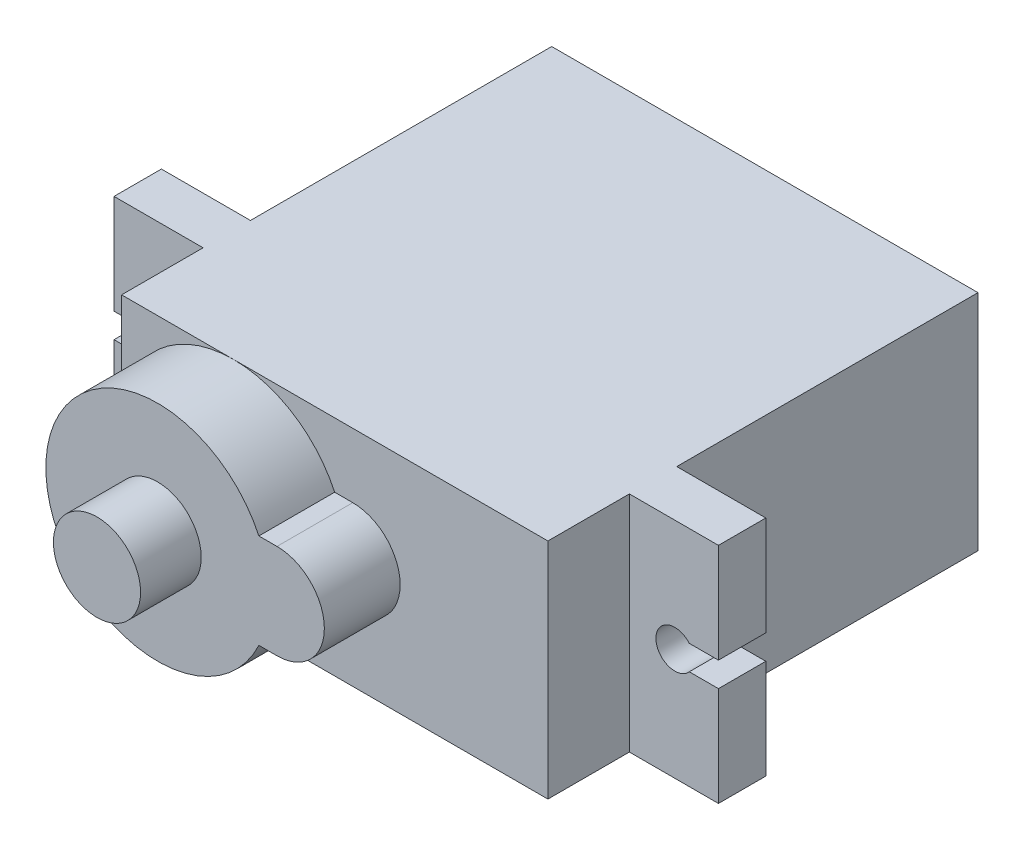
ISO-10303-21;
HEADER;
FILE_DESCRIPTION(('STEP AP214'),'2;1');
FILE_NAME('part.step','',(''),(''),'','','');
FILE_SCHEMA(('AUTOMOTIVE_DESIGN { 1 0 10303 214 1 1 1 1 }'));
ENDSEC;
DATA;
#1=APPLICATION_CONTEXT('core data for automotive mechanical design processes');
#2=APPLICATION_PROTOCOL_DEFINITION('international standard','automotive_design',2000,#1);
#3=PRODUCT_CONTEXT('',#1,'mechanical');
#4=PRODUCT('Part','Part','',(#3));
#5=PRODUCT_RELATED_PRODUCT_CATEGORY('part','',(#4));
#6=PRODUCT_DEFINITION_FORMATION('','',#4);
#7=PRODUCT_DEFINITION_CONTEXT('part definition',#1,'design');
#8=PRODUCT_DEFINITION('design','',#6,#7);
#9=PRODUCT_DEFINITION_SHAPE('','',#8);
#10=(LENGTH_UNIT() NAMED_UNIT(*) SI_UNIT(.MILLI.,.METRE.));
#11=(NAMED_UNIT(*) PLANE_ANGLE_UNIT() SI_UNIT($,.RADIAN.));
#12=(NAMED_UNIT(*) SI_UNIT($,.STERADIAN.) SOLID_ANGLE_UNIT());
#13=UNCERTAINTY_MEASURE_WITH_UNIT(LENGTH_MEASURE(1.E-05),#10,'distance_accuracy_value','');
#14=(GEOMETRIC_REPRESENTATION_CONTEXT(3) GLOBAL_UNCERTAINTY_ASSIGNED_CONTEXT((#13)) GLOBAL_UNIT_ASSIGNED_CONTEXT((#10,
#11,#12)) REPRESENTATION_CONTEXT('',''));
#15=CARTESIAN_POINT('',(0.,0.,0.));
#16=DIRECTION('',(0.,0.,1.));
#17=DIRECTION('',(1.,0.,0.));
#18=AXIS2_PLACEMENT_3D('',#15,#16,#17);
#19=CARTESIAN_POINT('',(-5.35,0.,21.95));
#20=DIRECTION('',(0.,0.,-1.));
#21=DIRECTION('',(0.,-1.,0.));
#22=AXIS2_PLACEMENT_3D('',#19,#20,#21);
#23=PLANE('',#22);
#24=CARTESIAN_POINT('',(-5.35,0.,21.95));
#25=DIRECTION('',(0.,0.,-1.));
#26=DIRECTION('',(1.,0.,0.));
#27=AXIS2_PLACEMENT_3D('',#24,#25,#26);
#28=CIRCLE('',#27,2.3);
#29=CARTESIAN_POINT('',(-3.05,0.,21.95));
#30=VERTEX_POINT('',#29);
#31=EDGE_CURVE('E10',#30,#30,#28,.T.);
#32=ORIENTED_EDGE('',*,*,#31,.F.);
#33=EDGE_LOOP('',(#32));
#34=FACE_BOUND('',#33,.T.);
#35=ADVANCED_FACE('F16',(#34),#23,.F.);
#36=CARTESIAN_POINT('',(-5.35,0.,21.95));
#37=DIRECTION('',(0.,0.,-1.));
#38=DIRECTION('',(-1.,0.,0.));
#39=AXIS2_PLACEMENT_3D('',#36,#37,#38);
#40=CYLINDRICAL_SURFACE('',#39,2.3);
#41=CARTESIAN_POINT('',(-5.35,0.,18.75));
#42=DIRECTION('',(0.,0.,-1.));
#43=DIRECTION('',(1.,0.,0.));
#44=AXIS2_PLACEMENT_3D('',#41,#42,#43);
#45=CIRCLE('',#44,2.3);
#46=CARTESIAN_POINT('',(-3.05,0.,18.75));
#47=VERTEX_POINT('',#46);
#48=EDGE_CURVE('E27',#47,#47,#45,.T.);
#49=ORIENTED_EDGE('',*,*,#48,.F.);
#50=EDGE_LOOP('',(#49));
#51=FACE_BOUND('',#50,.T.);
#52=ORIENTED_EDGE('',*,*,#31,.T.);
#53=EDGE_LOOP('',(#52));
#54=FACE_BOUND('',#53,.T.);
#55=ADVANCED_FACE('F627',(#51,#54),#40,.T.);
#56=CARTESIAN_POINT('',(-5.35,0.,18.75));
#57=DIRECTION('',(0.,0.,-1.));
#58=DIRECTION('',(0.,-1.,0.));
#59=AXIS2_PLACEMENT_3D('',#56,#57,#58);
#60=PLANE('',#59);
#61=DIRECTION('',(-1.,0.,0.));
#62=VECTOR('',#61,1.);
#63=CARTESIAN_POINT('',(0.95,-2.5,18.75));
#64=LINE('',#63,#62);
#65=CARTESIAN_POINT('',(0.95,-2.5,18.75));
#66=VERTEX_POINT('',#65);
#67=CARTESIAN_POINT('',(-0.0058443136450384,-2.5,18.75));
#68=VERTEX_POINT('',#67);
#69=EDGE_CURVE('E383',#66,#68,#64,.T.);
#70=ORIENTED_EDGE('',*,*,#69,.F.);
#71=CARTESIAN_POINT('',(0.95,0.,18.75));
#72=DIRECTION('',(0.,0.,-1.));
#73=DIRECTION('',(-1.,0.,0.));
#74=AXIS2_PLACEMENT_3D('',#71,#72,#73);
#75=CIRCLE('',#74,2.5);
#76=CARTESIAN_POINT('',(0.95,2.5,18.75));
#77=VERTEX_POINT('',#76);
#78=EDGE_CURVE('E290',#77,#66,#75,.T.);
#79=ORIENTED_EDGE('',*,*,#78,.F.);
#80=DIRECTION('',(1.,0.,0.));
#81=VECTOR('',#80,1.);
#82=CARTESIAN_POINT('',(0.95,2.5,18.75));
#83=LINE('',#82,#81);
#84=CARTESIAN_POINT('',(-0.005844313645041,2.5,18.75));
#85=VERTEX_POINT('',#84);
#86=EDGE_CURVE('E349',#85,#77,#83,.T.);
#87=ORIENTED_EDGE('',*,*,#86,.F.);
#88=CARTESIAN_POINT('',(-5.35,0.,18.75));
#89=DIRECTION('',(0.,0.,-1.));
#90=DIRECTION('',(1.,0.,0.));
#91=AXIS2_PLACEMENT_3D('',#88,#89,#90);
#92=CIRCLE('',#91,5.9);
#93=EDGE_CURVE('E390',#68,#85,#92,.T.);
#94=ORIENTED_EDGE('',*,*,#93,.F.);
#95=EDGE_LOOP('',(#70,#79,#87,#94));
#96=FACE_BOUND('',#95,.T.);
#97=ORIENTED_EDGE('',*,*,#48,.T.);
#98=EDGE_LOOP('',(#97));
#99=FACE_BOUND('',#98,.T.);
#100=ADVANCED_FACE('F578',(#96,#99),#60,.F.);
#101=CARTESIAN_POINT('',(0.95,0.,18.75));
#102=DIRECTION('',(0.,0.,-1.));
#103=DIRECTION('',(-1.,0.,0.));
#104=AXIS2_PLACEMENT_3D('',#101,#102,#103);
#105=CYLINDRICAL_SURFACE('',#104,2.5);
#106=CARTESIAN_POINT('',(0.95,0.,14.75));
#107=DIRECTION('',(0.,0.,-1.));
#108=DIRECTION('',(-1.,0.,0.));
#109=AXIS2_PLACEMENT_3D('',#106,#107,#108);
#110=CIRCLE('',#109,2.5);
#111=CARTESIAN_POINT('',(0.95,2.5,14.75));
#112=VERTEX_POINT('',#111);
#113=CARTESIAN_POINT('',(0.95,-2.5,14.75));
#114=VERTEX_POINT('',#113);
#115=EDGE_CURVE('E489',#112,#114,#110,.T.);
#116=ORIENTED_EDGE('',*,*,#115,.F.);
#117=DIRECTION('',(0.,0.,-1.));
#118=VECTOR('',#117,1.);
#119=CARTESIAN_POINT('',(0.95,2.5,18.75));
#120=LINE('',#119,#118);
#121=EDGE_CURVE('E20',#77,#112,#120,.T.);
#122=ORIENTED_EDGE('',*,*,#121,.F.);
#123=ORIENTED_EDGE('',*,*,#78,.T.);
#124=DIRECTION('',(0.,0.,-1.));
#125=VECTOR('',#124,1.);
#126=CARTESIAN_POINT('',(0.95,-2.5,18.75));
#127=LINE('',#126,#125);
#128=EDGE_CURVE('E324',#66,#114,#127,.T.);
#129=ORIENTED_EDGE('',*,*,#128,.T.);
#130=EDGE_LOOP('',(#116,#122,#123,#129));
#131=FACE_BOUND('',#130,.T.);
#132=ADVANCED_FACE('F544',(#131),#105,.T.);
#133=CARTESIAN_POINT('',(0.95,2.5,18.75));
#134=DIRECTION('',(0.,1.,0.));
#135=DIRECTION('',(1.,0.,0.));
#136=AXIS2_PLACEMENT_3D('',#133,#134,#135);
#137=PLANE('',#136);
#138=DIRECTION('',(1.,0.,0.));
#139=VECTOR('',#138,1.);
#140=CARTESIAN_POINT('',(0.95,2.5,14.75));
#141=LINE('',#140,#139);
#142=CARTESIAN_POINT('',(-0.005844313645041,2.5,14.75));
#143=VERTEX_POINT('',#142);
#144=EDGE_CURVE('E304',#143,#112,#141,.T.);
#145=ORIENTED_EDGE('',*,*,#144,.F.);
#146=DIRECTION('',(0.,0.,-1.));
#147=VECTOR('',#146,1.);
#148=CARTESIAN_POINT('',(-0.005844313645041,2.5,18.75));
#149=LINE('',#148,#147);
#150=EDGE_CURVE('E353',#85,#143,#149,.T.);
#151=ORIENTED_EDGE('',*,*,#150,.F.);
#152=ORIENTED_EDGE('',*,*,#86,.T.);
#153=ORIENTED_EDGE('',*,*,#121,.T.);
#154=EDGE_LOOP('',(#145,#151,#152,#153));
#155=FACE_BOUND('',#154,.T.);
#156=ADVANCED_FACE('F576',(#155),#137,.T.);
#157=CARTESIAN_POINT('',(-5.35,0.,18.75));
#158=DIRECTION('',(0.,0.,-1.));
#159=DIRECTION('',(-1.,0.,0.));
#160=AXIS2_PLACEMENT_3D('',#157,#158,#159);
#161=CYLINDRICAL_SURFACE('',#160,5.9);
#162=CARTESIAN_POINT('',(-5.35,0.,14.75));
#163=DIRECTION('',(0.,0.,-1.));
#164=DIRECTION('',(1.,0.,0.));
#165=AXIS2_PLACEMENT_3D('',#162,#163,#164);
#166=CIRCLE('',#165,5.9);
#167=CARTESIAN_POINT('',(-0.0058443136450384,-2.5,14.75));
#168=VERTEX_POINT('',#167);
#169=CARTESIAN_POINT('',(-5.35,-5.9,14.75));
#170=VERTEX_POINT('',#169);
#171=EDGE_CURVE('E338',#168,#170,#166,.T.);
#172=ORIENTED_EDGE('',*,*,#171,.F.);
#173=DIRECTION('',(0.,0.,-1.));
#174=VECTOR('',#173,1.);
#175=CARTESIAN_POINT('',(-0.0058443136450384,-2.5,18.75));
#176=LINE('',#175,#174);
#177=EDGE_CURVE('E387',#68,#168,#176,.T.);
#178=ORIENTED_EDGE('',*,*,#177,.F.);
#179=ORIENTED_EDGE('',*,*,#93,.T.);
#180=ORIENTED_EDGE('',*,*,#150,.T.);
#181=CARTESIAN_POINT('',(-5.35,0.,14.75));
#182=DIRECTION('',(0.,0.,-1.));
#183=DIRECTION('',(1.,0.,0.));
#184=AXIS2_PLACEMENT_3D('',#181,#182,#183);
#185=CIRCLE('',#184,5.9);
#186=CARTESIAN_POINT('',(-5.35,5.9,14.75));
#187=VERTEX_POINT('',#186);
#188=EDGE_CURVE('E300',#187,#143,#185,.T.);
#189=ORIENTED_EDGE('',*,*,#188,.F.);
#190=CARTESIAN_POINT('',(-5.35,0.,14.75));
#191=DIRECTION('',(0.,0.,-1.));
#192=DIRECTION('',(1.,0.,0.));
#193=AXIS2_PLACEMENT_3D('',#190,#191,#192);
#194=CIRCLE('',#193,5.9);
#195=CARTESIAN_POINT('',(-11.25,0.,14.75));
#196=VERTEX_POINT('',#195);
#197=EDGE_CURVE('E286',#196,#187,#194,.T.);
#198=ORIENTED_EDGE('',*,*,#197,.F.);
#199=CARTESIAN_POINT('',(-5.35,0.,14.75));
#200=DIRECTION('',(0.,0.,-1.));
#201=DIRECTION('',(1.,0.,0.));
#202=AXIS2_PLACEMENT_3D('',#199,#200,#201);
#203=CIRCLE('',#202,5.9);
#204=EDGE_CURVE('E428',#170,#196,#203,.T.);
#205=ORIENTED_EDGE('',*,*,#204,.F.);
#206=EDGE_LOOP('',(#172,#178,#179,#180,#189,#198,#205));
#207=FACE_BOUND('',#206,.T.);
#208=ADVANCED_FACE('F560',(#207),#161,.T.);
#209=CARTESIAN_POINT('',(0.95,-2.5,18.75));
#210=DIRECTION('',(0.,-1.,0.));
#211=DIRECTION('',(-1.,0.,0.));
#212=AXIS2_PLACEMENT_3D('',#209,#210,#211);
#213=PLANE('',#212);
#214=DIRECTION('',(-1.,0.,0.));
#215=VECTOR('',#214,1.);
#216=CARTESIAN_POINT('',(0.95,-2.5,14.75));
#217=LINE('',#216,#215);
#218=EDGE_CURVE('E342',#114,#168,#217,.T.);
#219=ORIENTED_EDGE('',*,*,#218,.F.);
#220=ORIENTED_EDGE('',*,*,#128,.F.);
#221=ORIENTED_EDGE('',*,*,#69,.T.);
#222=ORIENTED_EDGE('',*,*,#177,.T.);
#223=EDGE_LOOP('',(#219,#220,#221,#222));
#224=FACE_BOUND('',#223,.T.);
#225=ADVANCED_FACE('F551',(#224),#213,.T.);
#226=CARTESIAN_POINT('',(15.95,-0.65,3.82199239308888));
#227=DIRECTION('',(0.,1.,0.));
#228=DIRECTION('',(1.,0.,0.));
#229=AXIS2_PLACEMENT_3D('',#226,#227,#228);
#230=PLANE('',#229);
#231=DIRECTION('',(-1.,0.,0.));
#232=VECTOR('',#231,1.);
#233=CARTESIAN_POINT('',(0.,-0.65,7.95));
#234=LINE('',#233,#232);
#235=CARTESIAN_POINT('',(15.95,-0.65,7.95));
#236=VERTEX_POINT('',#235);
#237=CARTESIAN_POINT('',(14.4099342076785,-0.65,7.95));
#238=VERTEX_POINT('',#237);
#239=EDGE_CURVE('E272',#236,#238,#234,.T.);
#240=ORIENTED_EDGE('',*,*,#239,.T.);
#241=DIRECTION('',(0.,0.,1.));
#242=VECTOR('',#241,1.);
#243=CARTESIAN_POINT('',(14.4099342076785,-0.65,3.82199239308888));
#244=LINE('',#243,#242);
#245=CARTESIAN_POINT('',(14.4099342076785,-0.65,10.45));
#246=VERTEX_POINT('',#245);
#247=EDGE_CURVE('E320',#238,#246,#244,.T.);
#248=ORIENTED_EDGE('',*,*,#247,.T.);
#249=DIRECTION('',(-1.,0.,0.));
#250=VECTOR('',#249,1.);
#251=CARTESIAN_POINT('',(15.95,-0.65,10.45));
#252=LINE('',#251,#250);
#253=CARTESIAN_POINT('',(15.95,-0.65,10.45));
#254=VERTEX_POINT('',#253);
#255=EDGE_CURVE('E337',#254,#246,#252,.T.);
#256=ORIENTED_EDGE('',*,*,#255,.F.);
#257=DIRECTION('',(0.,0.,1.));
#258=VECTOR('',#257,1.);
#259=CARTESIAN_POINT('',(15.95,-0.65,3.82199239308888));
#260=LINE('',#259,#258);
#261=EDGE_CURVE('E276',#236,#254,#260,.T.);
#262=ORIENTED_EDGE('',*,*,#261,.F.);
#263=EDGE_LOOP('',(#240,#248,#256,#262));
#264=FACE_BOUND('',#263,.T.);
#265=ADVANCED_FACE('F601',(#264),#230,.T.);
#266=CARTESIAN_POINT('',(14.4099342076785,0.65,3.82199239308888));
#267=DIRECTION('',(0.,-1.,0.));
#268=DIRECTION('',(-1.,0.,0.));
#269=AXIS2_PLACEMENT_3D('',#266,#267,#268);
#270=PLANE('',#269);
#271=DIRECTION('',(1.,0.,0.));
#272=VECTOR('',#271,1.);
#273=CARTESIAN_POINT('',(0.,0.65,7.95));
#274=LINE('',#273,#272);
#275=CARTESIAN_POINT('',(14.4099342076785,0.65,7.95));
#276=VERTEX_POINT('',#275);
#277=CARTESIAN_POINT('',(15.95,0.65,7.95));
#278=VERTEX_POINT('',#277);
#279=EDGE_CURVE('E245',#276,#278,#274,.T.);
#280=ORIENTED_EDGE('',*,*,#279,.T.);
#281=DIRECTION('',(0.,0.,1.));
#282=VECTOR('',#281,1.);
#283=CARTESIAN_POINT('',(15.95,0.65,3.82199239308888));
#284=LINE('',#283,#282);
#285=CARTESIAN_POINT('',(15.95,0.65,10.45));
#286=VERTEX_POINT('',#285);
#287=EDGE_CURVE('E354',#278,#286,#284,.T.);
#288=ORIENTED_EDGE('',*,*,#287,.T.);
#289=DIRECTION('',(1.,0.,0.));
#290=VECTOR('',#289,1.);
#291=CARTESIAN_POINT('',(14.4099342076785,0.65,10.45));
#292=LINE('',#291,#290);
#293=CARTESIAN_POINT('',(14.4099342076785,0.65,10.45));
#294=VERTEX_POINT('',#293);
#295=EDGE_CURVE('E408',#294,#286,#292,.T.);
#296=ORIENTED_EDGE('',*,*,#295,.F.);
#297=DIRECTION('',(0.,0.,1.));
#298=VECTOR('',#297,1.);
#299=CARTESIAN_POINT('',(14.4099342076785,0.65,3.82199239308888));
#300=LINE('',#299,#298);
#301=EDGE_CURVE('E325',#276,#294,#300,.T.);
#302=ORIENTED_EDGE('',*,*,#301,.F.);
#303=EDGE_LOOP('',(#280,#288,#296,#302));
#304=FACE_BOUND('',#303,.T.);
#305=ADVANCED_FACE('F610',(#304),#270,.T.);
#306=CARTESIAN_POINT('',(13.65,0.,3.82199239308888));
#307=DIRECTION('',(0.,0.,1.));
#308=DIRECTION('',(1.,0.,0.));
#309=AXIS2_PLACEMENT_3D('',#306,#307,#308);
#310=CYLINDRICAL_SURFACE('',#309,1.);
#311=CARTESIAN_POINT('',(13.65,0.,7.95));
#312=DIRECTION('',(0.,0.,-1.));
#313=DIRECTION('',(1.,0.,0.));
#314=AXIS2_PLACEMENT_3D('',#311,#312,#313);
#315=CIRCLE('',#314,1.);
#316=EDGE_CURVE('E348',#238,#276,#315,.T.);
#317=ORIENTED_EDGE('',*,*,#316,.T.);
#318=ORIENTED_EDGE('',*,*,#301,.T.);
#319=CARTESIAN_POINT('',(13.65,0.,10.45));
#320=DIRECTION('',(0.,0.,-1.));
#321=DIRECTION('',(1.,0.,0.));
#322=AXIS2_PLACEMENT_3D('',#319,#320,#321);
#323=CIRCLE('',#322,1.);
#324=EDGE_CURVE('E345',#246,#294,#323,.T.);
#325=ORIENTED_EDGE('',*,*,#324,.F.);
#326=ORIENTED_EDGE('',*,*,#247,.F.);
#327=EDGE_LOOP('',(#317,#318,#325,#326));
#328=FACE_BOUND('',#327,.T.);
#329=ADVANCED_FACE('F607',(#328),#310,.F.);
#330=CARTESIAN_POINT('',(-14.4099342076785,-0.65,3.82199239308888));
#331=DIRECTION('',(0.,1.,0.));
#332=DIRECTION('',(1.,0.,0.));
#333=AXIS2_PLACEMENT_3D('',#330,#331,#332);
#334=PLANE('',#333);
#335=DIRECTION('',(-1.,0.,0.));
#336=VECTOR('',#335,1.);
#337=CARTESIAN_POINT('',(0.,-0.65,7.95));
#338=LINE('',#337,#336);
#339=CARTESIAN_POINT('',(-14.4099342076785,-0.65,7.95));
#340=VERTEX_POINT('',#339);
#341=CARTESIAN_POINT('',(-15.95,-0.65,7.95));
#342=VERTEX_POINT('',#341);
#343=EDGE_CURVE('E310',#340,#342,#338,.T.);
#344=ORIENTED_EDGE('',*,*,#343,.T.);
#345=DIRECTION('',(0.,0.,1.));
#346=VECTOR('',#345,1.);
#347=CARTESIAN_POINT('',(-15.95,-0.65,3.82199239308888));
#348=LINE('',#347,#346);
#349=CARTESIAN_POINT('',(-15.95,-0.65,10.45));
#350=VERTEX_POINT('',#349);
#351=EDGE_CURVE('E281',#342,#350,#348,.T.);
#352=ORIENTED_EDGE('',*,*,#351,.T.);
#353=DIRECTION('',(-1.,0.,0.));
#354=VECTOR('',#353,1.);
#355=CARTESIAN_POINT('',(-14.4099342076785,-0.65,10.45));
#356=LINE('',#355,#354);
#357=CARTESIAN_POINT('',(-14.4099342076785,-0.65,10.45));
#358=VERTEX_POINT('',#357);
#359=EDGE_CURVE('E326',#358,#350,#356,.T.);
#360=ORIENTED_EDGE('',*,*,#359,.F.);
#361=DIRECTION('',(0.,0.,1.));
#362=VECTOR('',#361,1.);
#363=CARTESIAN_POINT('',(-14.4099342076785,-0.65,3.82199239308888));
#364=LINE('',#363,#362);
#365=EDGE_CURVE('E282',#340,#358,#364,.T.);
#366=ORIENTED_EDGE('',*,*,#365,.F.);
#367=EDGE_LOOP('',(#344,#352,#360,#366));
#368=FACE_BOUND('',#367,.T.);
#369=ADVANCED_FACE('F646',(#368),#334,.T.);
#370=CARTESIAN_POINT('',(-15.95,0.65,3.82199239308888));
#371=DIRECTION('',(0.,-1.,0.));
#372=DIRECTION('',(0.,0.,-1.));
#373=AXIS2_PLACEMENT_3D('',#370,#371,#372);
#374=PLANE('',#373);
#375=DIRECTION('',(1.,0.,0.));
#376=VECTOR('',#375,1.);
#377=CARTESIAN_POINT('',(0.,0.65,7.95));
#378=LINE('',#377,#376);
#379=CARTESIAN_POINT('',(-15.95,0.65,7.95));
#380=VERTEX_POINT('',#379);
#381=CARTESIAN_POINT('',(-14.4099342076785,0.65,7.95));
#382=VERTEX_POINT('',#381);
#383=EDGE_CURVE('E376',#380,#382,#378,.T.);
#384=ORIENTED_EDGE('',*,*,#383,.T.);
#385=DIRECTION('',(0.,0.,1.));
#386=VECTOR('',#385,1.);
#387=CARTESIAN_POINT('',(-14.4099342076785,0.65,3.82199239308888));
#388=LINE('',#387,#386);
#389=CARTESIAN_POINT('',(-14.4099342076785,0.65,10.45));
#390=VERTEX_POINT('',#389);
#391=EDGE_CURVE('E285',#382,#390,#388,.T.);
#392=ORIENTED_EDGE('',*,*,#391,.T.);
#393=DIRECTION('',(1.,0.,0.));
#394=VECTOR('',#393,1.);
#395=CARTESIAN_POINT('',(-15.95,0.65,10.45));
#396=LINE('',#395,#394);
#397=CARTESIAN_POINT('',(-15.95,0.65,10.45));
#398=VERTEX_POINT('',#397);
#399=EDGE_CURVE('E370',#398,#390,#396,.T.);
#400=ORIENTED_EDGE('',*,*,#399,.F.);
#401=DIRECTION('',(0.,0.,1.));
#402=VECTOR('',#401,1.);
#403=CARTESIAN_POINT('',(-15.95,0.65,3.82199239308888));
#404=LINE('',#403,#402);
#405=EDGE_CURVE('E150',#380,#398,#404,.T.);
#406=ORIENTED_EDGE('',*,*,#405,.F.);
#407=EDGE_LOOP('',(#384,#392,#400,#406));
#408=FACE_BOUND('',#407,.T.);
#409=ADVANCED_FACE('F642',(#408),#374,.T.);
#410=CARTESIAN_POINT('',(-13.65,0.,3.82199239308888));
#411=DIRECTION('',(0.,0.,1.));
#412=DIRECTION('',(1.,0.,0.));
#413=AXIS2_PLACEMENT_3D('',#410,#411,#412);
#414=CYLINDRICAL_SURFACE('',#413,1.);
#415=CARTESIAN_POINT('',(-13.65,0.,7.95));
#416=DIRECTION('',(0.,0.,-1.));
#417=DIRECTION('',(1.,0.,0.));
#418=AXIS2_PLACEMENT_3D('',#415,#416,#417);
#419=CIRCLE('',#418,1.);
#420=EDGE_CURVE('E475',#382,#340,#419,.T.);
#421=ORIENTED_EDGE('',*,*,#420,.T.);
#422=ORIENTED_EDGE('',*,*,#365,.T.);
#423=CARTESIAN_POINT('',(-13.65,0.,10.45));
#424=DIRECTION('',(0.,0.,-1.));
#425=DIRECTION('',(-1.,0.,0.));
#426=AXIS2_PLACEMENT_3D('',#423,#424,#425);
#427=CIRCLE('',#426,1.);
#428=EDGE_CURVE('E331',#390,#358,#427,.T.);
#429=ORIENTED_EDGE('',*,*,#428,.F.);
#430=ORIENTED_EDGE('',*,*,#391,.F.);
#431=EDGE_LOOP('',(#421,#422,#429,#430));
#432=FACE_BOUND('',#431,.T.);
#433=ADVANCED_FACE('F645',(#432),#414,.F.);
#434=CARTESIAN_POINT('',(0.,0.,14.75));
#435=DIRECTION('',(0.,0.,-1.));
#436=DIRECTION('',(0.,-1.,0.));
#437=AXIS2_PLACEMENT_3D('',#434,#435,#436);
#438=PLANE('',#437);
#439=DIRECTION('',(0.,1.,0.));
#440=VECTOR('',#439,1.);
#441=CARTESIAN_POINT('',(-11.25,-5.9,14.75));
#442=LINE('',#441,#440);
#443=CARTESIAN_POINT('',(-11.25,5.9,14.75));
#444=VERTEX_POINT('',#443);
#445=EDGE_CURVE('E382',#196,#444,#442,.T.);
#446=ORIENTED_EDGE('',*,*,#445,.F.);
#447=ORIENTED_EDGE('',*,*,#197,.T.);
#448=DIRECTION('',(1.,0.,0.));
#449=VECTOR('',#448,1.);
#450=CARTESIAN_POINT('',(-11.25,5.9,14.75));
#451=LINE('',#450,#449);
#452=EDGE_CURVE('E365',#444,#187,#451,.T.);
#453=ORIENTED_EDGE('',*,*,#452,.F.);
#454=EDGE_LOOP('',(#446,#447,#453));
#455=FACE_BOUND('',#454,.T.);
#456=ADVANCED_FACE('F685',(#455),#438,.F.);
#457=CARTESIAN_POINT('',(11.25,5.9,14.75));
#458=DIRECTION('',(1.,0.,0.));
#459=DIRECTION('',(0.,1.,0.));
#460=AXIS2_PLACEMENT_3D('',#457,#458,#459);
#461=PLANE('',#460);
#462=DIRECTION('',(0.,-1.,0.));
#463=VECTOR('',#462,1.);
#464=CARTESIAN_POINT('',(11.25,5.9,10.45));
#465=LINE('',#464,#463);
#466=CARTESIAN_POINT('',(11.25,5.9,10.45));
#467=VERTEX_POINT('',#466);
#468=CARTESIAN_POINT('',(11.25,-5.9,10.45));
#469=VERTEX_POINT('',#468);
#470=EDGE_CURVE('E448',#467,#469,#465,.T.);
#471=ORIENTED_EDGE('',*,*,#470,.F.);
#472=DIRECTION('',(0.,0.,-1.));
#473=VECTOR('',#472,1.);
#474=CARTESIAN_POINT('',(11.25,5.9,14.75));
#475=LINE('',#474,#473);
#476=CARTESIAN_POINT('',(11.25,5.9,14.75));
#477=VERTEX_POINT('',#476);
#478=EDGE_CURVE('E246',#477,#467,#475,.T.);
#479=ORIENTED_EDGE('',*,*,#478,.F.);
#480=DIRECTION('',(0.,-1.,0.));
#481=VECTOR('',#480,1.);
#482=CARTESIAN_POINT('',(11.25,5.9,14.75));
#483=LINE('',#482,#481);
#484=CARTESIAN_POINT('',(11.25,-5.9,14.75));
#485=VERTEX_POINT('',#484);
#486=EDGE_CURVE('E315',#477,#485,#483,.T.);
#487=ORIENTED_EDGE('',*,*,#486,.T.);
#488=DIRECTION('',(0.,0.,-1.));
#489=VECTOR('',#488,1.);
#490=CARTESIAN_POINT('',(11.25,-5.9,14.75));
#491=LINE('',#490,#489);
#492=EDGE_CURVE('E314',#485,#469,#491,.T.);
#493=ORIENTED_EDGE('',*,*,#492,.T.);
#494=EDGE_LOOP('',(#471,#479,#487,#493));
#495=FACE_BOUND('',#494,.T.);
#496=ADVANCED_FACE('F573',(#495),#461,.T.);
#497=CARTESIAN_POINT('',(-11.25,-5.9,14.75));
#498=DIRECTION('',(-1.,0.,0.));
#499=DIRECTION('',(0.,0.,1.));
#500=AXIS2_PLACEMENT_3D('',#497,#498,#499);
#501=PLANE('',#500);
#502=DIRECTION('',(0.,1.,0.));
#503=VECTOR('',#502,1.);
#504=CARTESIAN_POINT('',(-11.25,-5.9,10.45));
#505=LINE('',#504,#503);
#506=CARTESIAN_POINT('',(-11.25,-5.9,10.45));
#507=VERTEX_POINT('',#506);
#508=CARTESIAN_POINT('',(-11.25,5.9,10.45));
#509=VERTEX_POINT('',#508);
#510=EDGE_CURVE('E294',#507,#509,#505,.T.);
#511=ORIENTED_EDGE('',*,*,#510,.F.);
#512=DIRECTION('',(0.,0.,-1.));
#513=VECTOR('',#512,1.);
#514=CARTESIAN_POINT('',(-11.25,-5.9,14.75));
#515=LINE('',#514,#513);
#516=CARTESIAN_POINT('',(-11.25,-5.9,14.75));
#517=VERTEX_POINT('',#516);
#518=EDGE_CURVE('E268',#517,#507,#515,.T.);
#519=ORIENTED_EDGE('',*,*,#518,.F.);
#520=DIRECTION('',(0.,1.,0.));
#521=VECTOR('',#520,1.);
#522=CARTESIAN_POINT('',(-11.25,-5.9,14.75));
#523=LINE('',#522,#521);
#524=EDGE_CURVE('E359',#517,#196,#523,.T.);
#525=ORIENTED_EDGE('',*,*,#524,.T.);
#526=ORIENTED_EDGE('',*,*,#445,.T.);
#527=DIRECTION('',(0.,0.,-1.));
#528=VECTOR('',#527,1.);
#529=CARTESIAN_POINT('',(-11.25,5.9,14.75));
#530=LINE('',#529,#528);
#531=EDGE_CURVE('E165',#444,#509,#530,.T.);
#532=ORIENTED_EDGE('',*,*,#531,.T.);
#533=EDGE_LOOP('',(#511,#519,#525,#526,#532));
#534=FACE_BOUND('',#533,.T.);
#535=ADVANCED_FACE('F18',(#534),#501,.T.);
#536=CARTESIAN_POINT('',(0.,0.,7.95));
#537=DIRECTION('',(0.,0.,1.));
#538=DIRECTION('',(1.,0.,0.));
#539=AXIS2_PLACEMENT_3D('',#536,#537,#538);
#540=PLANE('',#539);
#541=ORIENTED_EDGE('',*,*,#279,.F.);
#542=ORIENTED_EDGE('',*,*,#316,.F.);
#543=ORIENTED_EDGE('',*,*,#239,.F.);
#544=DIRECTION('',(0.,1.,0.));
#545=VECTOR('',#544,1.);
#546=CARTESIAN_POINT('',(15.95,-5.9,7.95));
#547=LINE('',#546,#545);
#548=CARTESIAN_POINT('',(15.95,-5.9,7.95));
#549=VERTEX_POINT('',#548);
#550=EDGE_CURVE('E371',#549,#236,#547,.T.);
#551=ORIENTED_EDGE('',*,*,#550,.F.);
#552=DIRECTION('',(1.,0.,0.));
#553=VECTOR('',#552,1.);
#554=CARTESIAN_POINT('',(-15.95,-5.9,7.95));
#555=LINE('',#554,#553);
#556=CARTESIAN_POINT('',(11.25,-5.9,7.95));
#557=VERTEX_POINT('',#556);
#558=EDGE_CURVE('E253',#557,#549,#555,.T.);
#559=ORIENTED_EDGE('',*,*,#558,.F.);
#560=DIRECTION('',(0.,1.,0.));
#561=VECTOR('',#560,1.);
#562=CARTESIAN_POINT('',(11.25,-5.9,7.95));
#563=LINE('',#562,#561);
#564=CARTESIAN_POINT('',(11.25,5.9,7.95));
#565=VERTEX_POINT('',#564);
#566=EDGE_CURVE('E249',#557,#565,#563,.T.);
#567=ORIENTED_EDGE('',*,*,#566,.T.);
#568=DIRECTION('',(-1.,0.,0.));
#569=VECTOR('',#568,1.);
#570=CARTESIAN_POINT('',(15.95,5.9,7.95));
#571=LINE('',#570,#569);
#572=CARTESIAN_POINT('',(15.95,5.9,7.95));
#573=VERTEX_POINT('',#572);
#574=EDGE_CURVE('E233',#573,#565,#571,.T.);
#575=ORIENTED_EDGE('',*,*,#574,.F.);
#576=DIRECTION('',(0.,1.,0.));
#577=VECTOR('',#576,1.);
#578=CARTESIAN_POINT('',(15.95,-5.9,7.95));
#579=LINE('',#578,#577);
#580=EDGE_CURVE('E358',#278,#573,#579,.T.);
#581=ORIENTED_EDGE('',*,*,#580,.F.);
#582=EDGE_LOOP('',(#541,#542,#543,#551,#559,#567,#575,#581));
#583=FACE_BOUND('',#582,.T.);
#584=ADVANCED_FACE('F251',(#583),#540,.F.);
#585=CARTESIAN_POINT('',(0.,0.,-7.95));
#586=DIRECTION('',(0.,0.,1.));
#587=DIRECTION('',(1.,0.,0.));
#588=AXIS2_PLACEMENT_3D('',#585,#586,#587);
#589=PLANE('',#588);
#590=DIRECTION('',(0.,-1.,0.));
#591=VECTOR('',#590,1.);
#592=CARTESIAN_POINT('',(-11.25,5.9,-7.95));
#593=LINE('',#592,#591);
#594=CARTESIAN_POINT('',(-11.25,5.9,-7.95));
#595=VERTEX_POINT('',#594);
#596=CARTESIAN_POINT('',(-11.25,-5.9,-7.95));
#597=VERTEX_POINT('',#596);
#598=EDGE_CURVE('E332',#595,#597,#593,.T.);
#599=ORIENTED_EDGE('',*,*,#598,.F.);
#600=DIRECTION('',(-1.,0.,0.));
#601=VECTOR('',#600,1.);
#602=CARTESIAN_POINT('',(11.25,5.9,-7.95));
#603=LINE('',#602,#601);
#604=CARTESIAN_POINT('',(11.25,5.9,-7.95));
#605=VERTEX_POINT('',#604);
#606=EDGE_CURVE('E258',#605,#595,#603,.T.);
#607=ORIENTED_EDGE('',*,*,#606,.F.);
#608=DIRECTION('',(0.,1.,0.));
#609=VECTOR('',#608,1.);
#610=CARTESIAN_POINT('',(11.25,-5.9,-7.95));
#611=LINE('',#610,#609);
#612=CARTESIAN_POINT('',(11.25,-5.9,-7.95));
#613=VERTEX_POINT('',#612);
#614=EDGE_CURVE('E261',#613,#605,#611,.T.);
#615=ORIENTED_EDGE('',*,*,#614,.F.);
#616=DIRECTION('',(1.,0.,0.));
#617=VECTOR('',#616,1.);
#618=CARTESIAN_POINT('',(-11.25,-5.9,-7.95));
#619=LINE('',#618,#617);
#620=EDGE_CURVE('E467',#597,#613,#619,.T.);
#621=ORIENTED_EDGE('',*,*,#620,.F.);
#622=EDGE_LOOP('',(#599,#607,#615,#621));
#623=FACE_BOUND('',#622,.T.);
#624=ADVANCED_FACE('F892',(#623),#589,.F.);
#625=CARTESIAN_POINT('',(11.25,5.9,7.95));
#626=DIRECTION('',(0.,-1.,0.));
#627=DIRECTION('',(0.,0.,-1.));
#628=AXIS2_PLACEMENT_3D('',#625,#626,#627);
#629=PLANE('',#628);
#630=ORIENTED_EDGE('',*,*,#606,.T.);
#631=DIRECTION('',(0.,0.,-1.));
#632=VECTOR('',#631,1.);
#633=CARTESIAN_POINT('',(-11.25,5.9,7.95));
#634=LINE('',#633,#632);
#635=CARTESIAN_POINT('',(-11.25,5.9,7.95));
#636=VERTEX_POINT('',#635);
#637=EDGE_CURVE('E399',#636,#595,#634,.T.);
#638=ORIENTED_EDGE('',*,*,#637,.F.);
#639=DIRECTION('',(-1.,0.,0.));
#640=VECTOR('',#639,1.);
#641=CARTESIAN_POINT('',(15.95,5.9,7.95));
#642=LINE('',#641,#640);
#643=CARTESIAN_POINT('',(-15.95,5.9,7.95));
#644=VERTEX_POINT('',#643);
#645=EDGE_CURVE('E375',#636,#644,#642,.T.);
#646=ORIENTED_EDGE('',*,*,#645,.T.);
#647=DIRECTION('',(0.,0.,-1.));
#648=VECTOR('',#647,1.);
#649=CARTESIAN_POINT('',(-15.95,5.9,10.45));
#650=LINE('',#649,#648);
#651=CARTESIAN_POINT('',(-15.95,5.9,10.45));
#652=VERTEX_POINT('',#651);
#653=EDGE_CURVE('E278',#652,#644,#650,.T.);
#654=ORIENTED_EDGE('',*,*,#653,.F.);
#655=DIRECTION('',(-1.,0.,0.));
#656=VECTOR('',#655,1.);
#657=CARTESIAN_POINT('',(15.95,5.9,10.45));
#658=LINE('',#657,#656);
#659=EDGE_CURVE('E298',#509,#652,#658,.T.);
#660=ORIENTED_EDGE('',*,*,#659,.F.);
#661=ORIENTED_EDGE('',*,*,#531,.F.);
#662=ORIENTED_EDGE('',*,*,#452,.T.);
#663=DIRECTION('',(1.,0.,0.));
#664=VECTOR('',#663,1.);
#665=CARTESIAN_POINT('',(-11.25,5.9,14.75));
#666=LINE('',#665,#664);
#667=EDGE_CURVE('E305',#187,#477,#666,.T.);
#668=ORIENTED_EDGE('',*,*,#667,.T.);
#669=ORIENTED_EDGE('',*,*,#478,.T.);
#670=DIRECTION('',(-1.,0.,0.));
#671=VECTOR('',#670,1.);
#672=CARTESIAN_POINT('',(15.95,5.9,10.45));
#673=LINE('',#672,#671);
#674=CARTESIAN_POINT('',(15.95,5.9,10.45));
#675=VERTEX_POINT('',#674);
#676=EDGE_CURVE('E452',#675,#467,#673,.T.);
#677=ORIENTED_EDGE('',*,*,#676,.F.);
#678=DIRECTION('',(0.,0.,-1.));
#679=VECTOR('',#678,1.);
#680=CARTESIAN_POINT('',(15.95,5.9,10.45));
#681=LINE('',#680,#679);
#682=EDGE_CURVE('E240',#675,#573,#681,.T.);
#683=ORIENTED_EDGE('',*,*,#682,.T.);
#684=ORIENTED_EDGE('',*,*,#574,.T.);
#685=DIRECTION('',(0.,0.,-1.));
#686=VECTOR('',#685,1.);
#687=CARTESIAN_POINT('',(11.25,5.9,7.95));
#688=LINE('',#687,#686);
#689=EDGE_CURVE('E237',#565,#605,#688,.T.);
#690=ORIENTED_EDGE('',*,*,#689,.T.);
#691=EDGE_LOOP('',(#630,#638,#646,#654,#660,#661,#662,#668,#669,#677,#683,#684,#690));
#692=FACE_BOUND('',#691,.T.);
#693=ADVANCED_FACE('F235',(#692),#629,.F.);
#694=CARTESIAN_POINT('',(11.25,-5.9,7.95));
#695=DIRECTION('',(-1.,0.,0.));
#696=DIRECTION('',(0.,0.,1.));
#697=AXIS2_PLACEMENT_3D('',#694,#695,#696);
#698=PLANE('',#697);
#699=ORIENTED_EDGE('',*,*,#614,.T.);
#700=ORIENTED_EDGE('',*,*,#689,.F.);
#701=ORIENTED_EDGE('',*,*,#566,.F.);
#702=DIRECTION('',(0.,0.,-1.));
#703=VECTOR('',#702,1.);
#704=CARTESIAN_POINT('',(11.25,-5.9,7.95));
#705=LINE('',#704,#703);
#706=EDGE_CURVE('E471',#557,#613,#705,.T.);
#707=ORIENTED_EDGE('',*,*,#706,.T.);
#708=EDGE_LOOP('',(#699,#700,#701,#707));
#709=FACE_BOUND('',#708,.T.);
#710=ADVANCED_FACE('F260',(#709),#698,.F.);
#711=CARTESIAN_POINT('',(-11.25,-5.9,7.95));
#712=DIRECTION('',(0.,1.,0.));
#713=DIRECTION('',(1.,0.,0.));
#714=AXIS2_PLACEMENT_3D('',#711,#712,#713);
#715=PLANE('',#714);
#716=ORIENTED_EDGE('',*,*,#620,.T.);
#717=ORIENTED_EDGE('',*,*,#706,.F.);
#718=ORIENTED_EDGE('',*,*,#558,.T.);
#719=DIRECTION('',(0.,0.,-1.));
#720=VECTOR('',#719,1.);
#721=CARTESIAN_POINT('',(15.95,-5.9,10.45));
#722=LINE('',#721,#720);
#723=CARTESIAN_POINT('',(15.95,-5.9,10.45));
#724=VERTEX_POINT('',#723);
#725=EDGE_CURVE('E413',#724,#549,#722,.T.);
#726=ORIENTED_EDGE('',*,*,#725,.F.);
#727=DIRECTION('',(1.,0.,0.));
#728=VECTOR('',#727,1.);
#729=CARTESIAN_POINT('',(-15.95,-5.9,10.45));
#730=LINE('',#729,#728);
#731=EDGE_CURVE('E451',#469,#724,#730,.T.);
#732=ORIENTED_EDGE('',*,*,#731,.F.);
#733=ORIENTED_EDGE('',*,*,#492,.F.);
#734=DIRECTION('',(-1.,0.,0.));
#735=VECTOR('',#734,1.);
#736=CARTESIAN_POINT('',(11.25,-5.9,14.75));
#737=LINE('',#736,#735);
#738=EDGE_CURVE('E319',#485,#170,#737,.T.);
#739=ORIENTED_EDGE('',*,*,#738,.T.);
#740=DIRECTION('',(-1.,0.,0.));
#741=VECTOR('',#740,1.);
#742=CARTESIAN_POINT('',(11.25,-5.9,14.75));
#743=LINE('',#742,#741);
#744=EDGE_CURVE('E424',#170,#517,#743,.T.);
#745=ORIENTED_EDGE('',*,*,#744,.T.);
#746=ORIENTED_EDGE('',*,*,#518,.T.);
#747=DIRECTION('',(1.,0.,0.));
#748=VECTOR('',#747,1.);
#749=CARTESIAN_POINT('',(-15.95,-5.9,10.45));
#750=LINE('',#749,#748);
#751=CARTESIAN_POINT('',(-15.95,-5.9,10.45));
#752=VERTEX_POINT('',#751);
#753=EDGE_CURVE('E299',#752,#507,#750,.T.);
#754=ORIENTED_EDGE('',*,*,#753,.F.);
#755=DIRECTION('',(0.,0.,-1.));
#756=VECTOR('',#755,1.);
#757=CARTESIAN_POINT('',(-15.95,-5.9,10.45));
#758=LINE('',#757,#756);
#759=CARTESIAN_POINT('',(-15.95,-5.9,7.95));
#760=VERTEX_POINT('',#759);
#761=EDGE_CURVE('E289',#752,#760,#758,.T.);
#762=ORIENTED_EDGE('',*,*,#761,.T.);
#763=DIRECTION('',(1.,0.,0.));
#764=VECTOR('',#763,1.);
#765=CARTESIAN_POINT('',(-15.95,-5.9,7.95));
#766=LINE('',#765,#764);
#767=CARTESIAN_POINT('',(-11.25,-5.9,7.95));
#768=VERTEX_POINT('',#767);
#769=EDGE_CURVE('E311',#760,#768,#766,.T.);
#770=ORIENTED_EDGE('',*,*,#769,.T.);
#771=DIRECTION('',(0.,0.,-1.));
#772=VECTOR('',#771,1.);
#773=CARTESIAN_POINT('',(-11.25,-5.9,7.95));
#774=LINE('',#773,#772);
#775=EDGE_CURVE('E336',#768,#597,#774,.T.);
#776=ORIENTED_EDGE('',*,*,#775,.T.);
#777=EDGE_LOOP('',(#716,#717,#718,#726,#732,#733,#739,#745,#746,#754,#762,#770,#776));
#778=FACE_BOUND('',#777,.T.);
#779=ADVANCED_FACE('F568',(#778),#715,.F.);
#780=CARTESIAN_POINT('',(-11.25,5.9,7.95));
#781=DIRECTION('',(1.,0.,0.));
#782=DIRECTION('',(0.,1.,0.));
#783=AXIS2_PLACEMENT_3D('',#780,#781,#782);
#784=PLANE('',#783);
#785=ORIENTED_EDGE('',*,*,#598,.T.);
#786=ORIENTED_EDGE('',*,*,#775,.F.);
#787=DIRECTION('',(0.,-1.,0.));
#788=VECTOR('',#787,1.);
#789=CARTESIAN_POINT('',(-11.25,5.9,7.95));
#790=LINE('',#789,#788);
#791=EDGE_CURVE('E414',#636,#768,#790,.T.);
#792=ORIENTED_EDGE('',*,*,#791,.F.);
#793=ORIENTED_EDGE('',*,*,#637,.T.);
#794=EDGE_LOOP('',(#785,#786,#792,#793));
#795=FACE_BOUND('',#794,.T.);
#796=ADVANCED_FACE('F677',(#795),#784,.F.);
#797=CARTESIAN_POINT('',(0.,0.,10.45));
#798=DIRECTION('',(0.,0.,1.));
#799=DIRECTION('',(1.,0.,0.));
#800=AXIS2_PLACEMENT_3D('',#797,#798,#799);
#801=PLANE('',#800);
#802=ORIENTED_EDGE('',*,*,#324,.T.);
#803=ORIENTED_EDGE('',*,*,#295,.T.);
#804=DIRECTION('',(0.,1.,0.));
#805=VECTOR('',#804,1.);
#806=CARTESIAN_POINT('',(15.95,-5.9,10.45));
#807=LINE('',#806,#805);
#808=EDGE_CURVE('E274',#286,#675,#807,.T.);
#809=ORIENTED_EDGE('',*,*,#808,.T.);
#810=ORIENTED_EDGE('',*,*,#676,.T.);
#811=ORIENTED_EDGE('',*,*,#470,.T.);
#812=ORIENTED_EDGE('',*,*,#731,.T.);
#813=DIRECTION('',(0.,1.,0.));
#814=VECTOR('',#813,1.);
#815=CARTESIAN_POINT('',(15.95,-5.9,10.45));
#816=LINE('',#815,#814);
#817=EDGE_CURVE('E409',#724,#254,#816,.T.);
#818=ORIENTED_EDGE('',*,*,#817,.T.);
#819=ORIENTED_EDGE('',*,*,#255,.T.);
#820=EDGE_LOOP('',(#802,#803,#809,#810,#811,#812,#818,#819));
#821=FACE_BOUND('',#820,.T.);
#822=ADVANCED_FACE('F605',(#821),#801,.T.);
#823=CARTESIAN_POINT('',(-15.95,5.9,10.45));
#824=DIRECTION('',(1.,0.,0.));
#825=DIRECTION('',(0.,1.,0.));
#826=AXIS2_PLACEMENT_3D('',#823,#824,#825);
#827=PLANE('',#826);
#828=ORIENTED_EDGE('',*,*,#351,.F.);
#829=DIRECTION('',(0.,-1.,0.));
#830=VECTOR('',#829,1.);
#831=CARTESIAN_POINT('',(-15.95,5.9,7.95));
#832=LINE('',#831,#830);
#833=EDGE_CURVE('E306',#342,#760,#832,.T.);
#834=ORIENTED_EDGE('',*,*,#833,.T.);
#835=ORIENTED_EDGE('',*,*,#761,.F.);
#836=DIRECTION('',(0.,-1.,0.));
#837=VECTOR('',#836,1.);
#838=CARTESIAN_POINT('',(-15.95,5.9,10.45));
#839=LINE('',#838,#837);
#840=EDGE_CURVE('E330',#350,#752,#839,.T.);
#841=ORIENTED_EDGE('',*,*,#840,.F.);
#842=EDGE_LOOP('',(#828,#834,#835,#841));
#843=FACE_BOUND('',#842,.T.);
#844=ADVANCED_FACE('F669',(#843),#827,.F.);
#845=CARTESIAN_POINT('',(-15.95,5.9,10.45));
#846=DIRECTION('',(1.,0.,0.));
#847=DIRECTION('',(0.,1.,0.));
#848=AXIS2_PLACEMENT_3D('',#845,#846,#847);
#849=PLANE('',#848);
#850=ORIENTED_EDGE('',*,*,#405,.T.);
#851=DIRECTION('',(0.,-1.,0.));
#852=VECTOR('',#851,1.);
#853=CARTESIAN_POINT('',(-15.95,5.9,10.45));
#854=LINE('',#853,#852);
#855=EDGE_CURVE('E366',#652,#398,#854,.T.);
#856=ORIENTED_EDGE('',*,*,#855,.F.);
#857=ORIENTED_EDGE('',*,*,#653,.T.);
#858=DIRECTION('',(0.,-1.,0.));
#859=VECTOR('',#858,1.);
#860=CARTESIAN_POINT('',(-15.95,5.9,7.95));
#861=LINE('',#860,#859);
#862=EDGE_CURVE('E372',#644,#380,#861,.T.);
#863=ORIENTED_EDGE('',*,*,#862,.T.);
#864=EDGE_LOOP('',(#850,#856,#857,#863));
#865=FACE_BOUND('',#864,.T.);
#866=ADVANCED_FACE('F640',(#865),#849,.F.);
#867=CARTESIAN_POINT('',(0.,0.,7.95));
#868=DIRECTION('',(0.,0.,1.));
#869=DIRECTION('',(1.,0.,0.));
#870=AXIS2_PLACEMENT_3D('',#867,#868,#869);
#871=PLANE('',#870);
#872=ORIENTED_EDGE('',*,*,#383,.F.);
#873=ORIENTED_EDGE('',*,*,#862,.F.);
#874=ORIENTED_EDGE('',*,*,#645,.F.);
#875=ORIENTED_EDGE('',*,*,#791,.T.);
#876=ORIENTED_EDGE('',*,*,#769,.F.);
#877=ORIENTED_EDGE('',*,*,#833,.F.);
#878=ORIENTED_EDGE('',*,*,#343,.F.);
#879=ORIENTED_EDGE('',*,*,#420,.F.);
#880=EDGE_LOOP('',(#872,#873,#874,#875,#876,#877,#878,#879));
#881=FACE_BOUND('',#880,.T.);
#882=ADVANCED_FACE('F637',(#881),#871,.F.);
#883=CARTESIAN_POINT('',(0.,0.,10.45));
#884=DIRECTION('',(0.,0.,1.));
#885=DIRECTION('',(1.,0.,0.));
#886=AXIS2_PLACEMENT_3D('',#883,#884,#885);
#887=PLANE('',#886);
#888=ORIENTED_EDGE('',*,*,#855,.T.);
#889=ORIENTED_EDGE('',*,*,#399,.T.);
#890=ORIENTED_EDGE('',*,*,#428,.T.);
#891=ORIENTED_EDGE('',*,*,#359,.T.);
#892=ORIENTED_EDGE('',*,*,#840,.T.);
#893=ORIENTED_EDGE('',*,*,#753,.T.);
#894=ORIENTED_EDGE('',*,*,#510,.T.);
#895=ORIENTED_EDGE('',*,*,#659,.T.);
#896=EDGE_LOOP('',(#888,#889,#890,#891,#892,#893,#894,#895));
#897=FACE_BOUND('',#896,.T.);
#898=ADVANCED_FACE('F622',(#897),#887,.T.);
#899=CARTESIAN_POINT('',(15.95,-5.9,10.45));
#900=DIRECTION('',(-1.,0.,0.));
#901=DIRECTION('',(0.,0.,1.));
#902=AXIS2_PLACEMENT_3D('',#899,#900,#901);
#903=PLANE('',#902);
#904=ORIENTED_EDGE('',*,*,#261,.T.);
#905=ORIENTED_EDGE('',*,*,#817,.F.);
#906=ORIENTED_EDGE('',*,*,#725,.T.);
#907=ORIENTED_EDGE('',*,*,#550,.T.);
#908=EDGE_LOOP('',(#904,#905,#906,#907));
#909=FACE_BOUND('',#908,.T.);
#910=ADVANCED_FACE('F614',(#909),#903,.F.);
#911=CARTESIAN_POINT('',(15.95,-5.9,10.45));
#912=DIRECTION('',(-1.,0.,0.));
#913=DIRECTION('',(0.,0.,1.));
#914=AXIS2_PLACEMENT_3D('',#911,#912,#913);
#915=PLANE('',#914);
#916=ORIENTED_EDGE('',*,*,#287,.F.);
#917=ORIENTED_EDGE('',*,*,#580,.T.);
#918=ORIENTED_EDGE('',*,*,#682,.F.);
#919=ORIENTED_EDGE('',*,*,#808,.F.);
#920=EDGE_LOOP('',(#916,#917,#918,#919));
#921=FACE_BOUND('',#920,.T.);
#922=ADVANCED_FACE('F612',(#921),#915,.F.);
#923=CARTESIAN_POINT('',(0.,0.,14.75));
#924=DIRECTION('',(0.,0.,-1.));
#925=DIRECTION('',(0.,-1.,0.));
#926=AXIS2_PLACEMENT_3D('',#923,#924,#925);
#927=PLANE('',#926);
#928=ORIENTED_EDGE('',*,*,#744,.F.);
#929=ORIENTED_EDGE('',*,*,#204,.T.);
#930=ORIENTED_EDGE('',*,*,#524,.F.);
#931=EDGE_LOOP('',(#928,#929,#930));
#932=FACE_BOUND('',#931,.T.);
#933=ADVANCED_FACE('F565',(#932),#927,.F.);
#934=CARTESIAN_POINT('',(0.,0.,14.75));
#935=DIRECTION('',(0.,0.,-1.));
#936=DIRECTION('',(0.,-1.,0.));
#937=AXIS2_PLACEMENT_3D('',#934,#935,#936);
#938=PLANE('',#937);
#939=ORIENTED_EDGE('',*,*,#115,.T.);
#940=ORIENTED_EDGE('',*,*,#218,.T.);
#941=ORIENTED_EDGE('',*,*,#171,.T.);
#942=ORIENTED_EDGE('',*,*,#738,.F.);
#943=ORIENTED_EDGE('',*,*,#486,.F.);
#944=ORIENTED_EDGE('',*,*,#667,.F.);
#945=ORIENTED_EDGE('',*,*,#188,.T.);
#946=ORIENTED_EDGE('',*,*,#144,.T.);
#947=EDGE_LOOP('',(#939,#940,#941,#942,#943,#944,#945,#946));
#948=FACE_BOUND('',#947,.T.);
#949=ADVANCED_FACE('F537',(#948),#938,.F.);
#950=CLOSED_SHELL('',(#35,#55,#100,#132,#156,#208,#225,#265,#305,#329,#369,#409,#433,#456,#496,
#535,#584,#624,#693,#710,#779,#796,#822,#844,#866,#882,#898,#910,#922,#933,#949));
#951=MANIFOLD_SOLID_BREP('B1',#950);
#952=ADVANCED_BREP_SHAPE_REPRESENTATION('',(#18,#951),#14);
#953=SHAPE_DEFINITION_REPRESENTATION(#9,#952);
ENDSEC;
END-ISO-10303-21;
